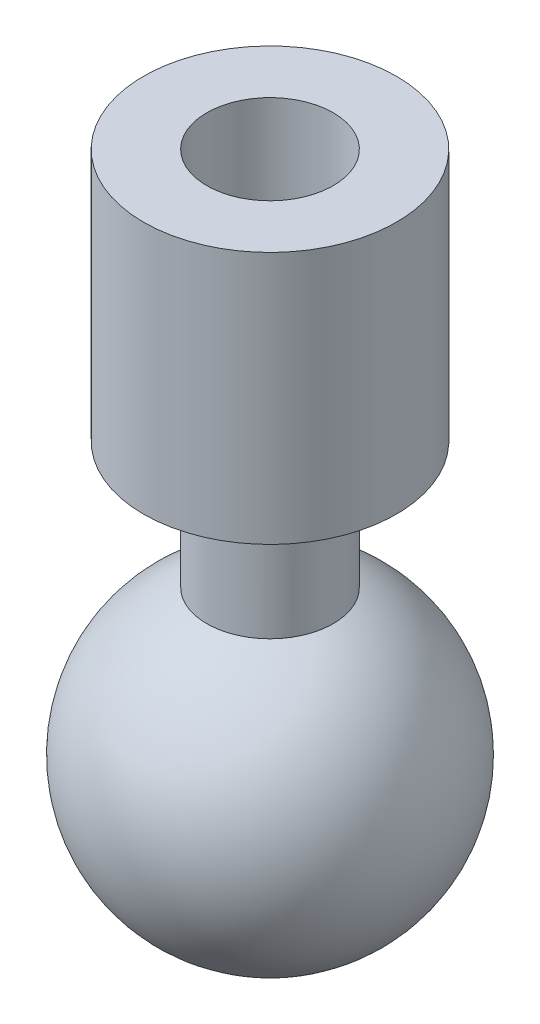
from build123d import *


with BuildPart() as part:
    # Sketch1 → Revolve1 (revolve)
    with BuildSketch(Plane.XY, mode=Mode.PRIVATE) as revolve1_sk:
        with BuildLine():
            Line((0, 0), (0, 7.791287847))
            Line((0, 7.791287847), (1, 7.791287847))
            Line((1, 7.791287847), (1, 10.791287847))
            Line((1, 10.791287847), (2, 10.791287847))
            Line((2, 10.791287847), (2, 6.791287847))
            Line((2, 6.791287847), (1, 6.791287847))
            Line((1, 6.791287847), (1, 4.791287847))
            ThreePointArc((1, 4.791287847), (2.447265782, 1.989225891), (0, 0))
        make_face()
    revolve(revolve1_sk.sketch.rotate(Axis((0, 0, 0), (0, 1, 0)), 90), axis=Axis((0, 0, 0), (0, 1, 0)))


solid = part.part
